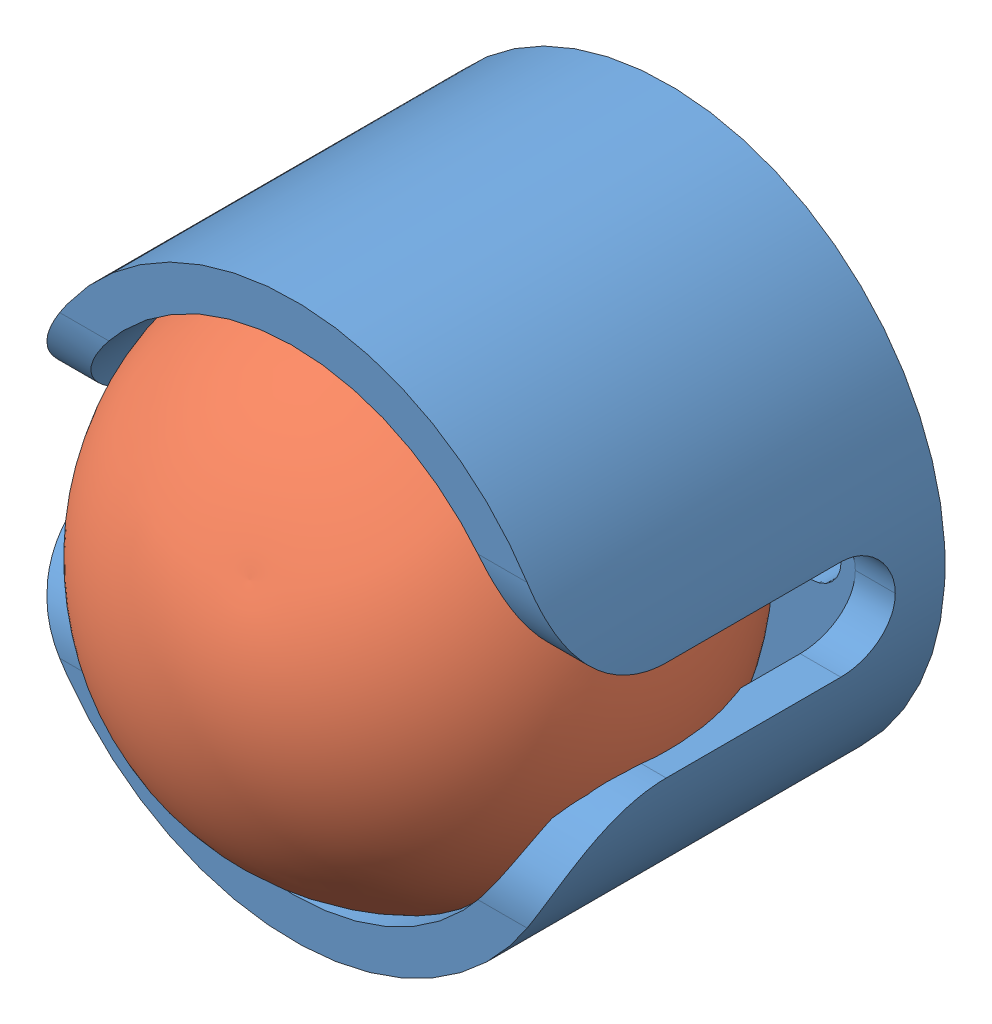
SolidWorks assembly Ball_Housing_Assembly.SLDASM, configuration Default (file format 9000). Lengths in mm.
Overall size (27.34 29.21 30.03).
2 component instances, 2 part files, 1 mates.
Components (placement in the parent):
- Ball Housing-1: Ball Housing.SLDPRT [Default] at (-7.9416 18.847 -16.1137) size (22.25 22.25 15)
- Ball-1: Ball.SLDPRT [Default] at (-9.5077 14.2814 -14.4552) x (-0.957829 -0.137876 0.252098) z (-0.233447 0.884933 -0.402985) size (20.27 19.04 20.27)
Mates (geometry in assembly coordinates):
- Tangent5: tangent: circle of Ball Housing-1; torus of Ball-1
